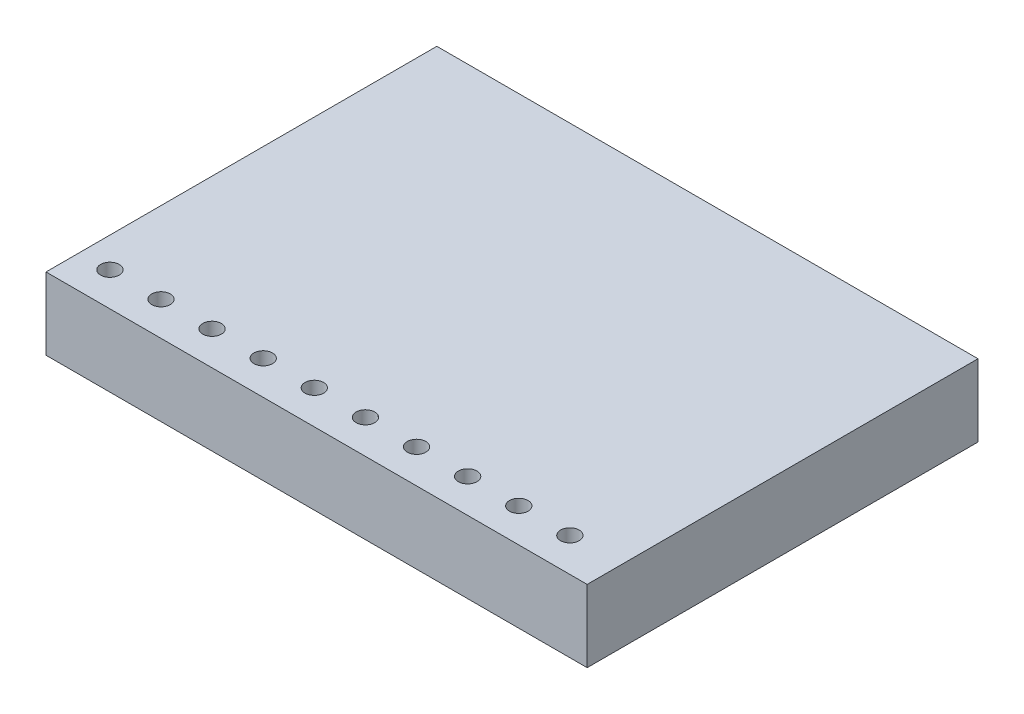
ISO-10303-21;
HEADER;
FILE_DESCRIPTION(('STEP AP214'),'2;1');
FILE_NAME('part.step','',(''),(''),'','','');
FILE_SCHEMA(('AUTOMOTIVE_DESIGN { 1 0 10303 214 1 1 1 1 }'));
ENDSEC;
DATA;
#1=APPLICATION_CONTEXT('core data for automotive mechanical design processes');
#2=APPLICATION_PROTOCOL_DEFINITION('international standard','automotive_design',2000,#1);
#3=PRODUCT_CONTEXT('',#1,'mechanical');
#4=PRODUCT('Part','Part','',(#3));
#5=PRODUCT_RELATED_PRODUCT_CATEGORY('part','',(#4));
#6=PRODUCT_DEFINITION_FORMATION('','',#4);
#7=PRODUCT_DEFINITION_CONTEXT('part definition',#1,'design');
#8=PRODUCT_DEFINITION('design','',#6,#7);
#9=PRODUCT_DEFINITION_SHAPE('','',#8);
#10=(LENGTH_UNIT() NAMED_UNIT(*) SI_UNIT(.MILLI.,.METRE.));
#11=(NAMED_UNIT(*) PLANE_ANGLE_UNIT() SI_UNIT($,.RADIAN.));
#12=(NAMED_UNIT(*) SI_UNIT($,.STERADIAN.) SOLID_ANGLE_UNIT());
#13=UNCERTAINTY_MEASURE_WITH_UNIT(LENGTH_MEASURE(1.E-05),#10,'distance_accuracy_value','');
#14=(GEOMETRIC_REPRESENTATION_CONTEXT(3) GLOBAL_UNCERTAINTY_ASSIGNED_CONTEXT((#13)) GLOBAL_UNIT_ASSIGNED_CONTEXT((#10,
#11,#12)) REPRESENTATION_CONTEXT('',''));
#15=CARTESIAN_POINT('',(0.,0.,0.));
#16=DIRECTION('',(0.,0.,1.));
#17=DIRECTION('',(1.,0.,0.));
#18=AXIS2_PLACEMENT_3D('',#15,#16,#17);
#19=CARTESIAN_POINT('',(-45.,12.,-32.5));
#20=DIRECTION('',(1.,0.,0.));
#21=DIRECTION('',(0.,0.,-1.));
#22=AXIS2_PLACEMENT_3D('',#19,#20,#21);
#23=PLANE('',#22);
#24=DIRECTION('',(0.,0.,1.));
#25=VECTOR('',#24,1.);
#26=CARTESIAN_POINT('',(-45.,0.,-32.5));
#27=LINE('',#26,#25);
#28=CARTESIAN_POINT('',(-45.,0.,-32.5));
#29=VERTEX_POINT('',#28);
#30=CARTESIAN_POINT('',(-45.,0.,32.5));
#31=VERTEX_POINT('',#30);
#32=EDGE_CURVE('E79',#29,#31,#27,.T.);
#33=ORIENTED_EDGE('',*,*,#32,.T.);
#34=DIRECTION('',(0.,-1.,0.));
#35=VECTOR('',#34,1.);
#36=CARTESIAN_POINT('',(-45.,12.,32.5));
#37=LINE('',#36,#35);
#38=CARTESIAN_POINT('',(-45.,12.,32.5));
#39=VERTEX_POINT('',#38);
#40=EDGE_CURVE('E86',#39,#31,#37,.T.);
#41=ORIENTED_EDGE('',*,*,#40,.F.);
#42=DIRECTION('',(0.,0.,1.));
#43=VECTOR('',#42,1.);
#44=CARTESIAN_POINT('',(-45.,12.,-32.5));
#45=LINE('',#44,#43);
#46=CARTESIAN_POINT('',(-45.,12.,-32.5));
#47=VERTEX_POINT('',#46);
#48=EDGE_CURVE('E106',#47,#39,#45,.T.);
#49=ORIENTED_EDGE('',*,*,#48,.F.);
#50=DIRECTION('',(0.,-1.,0.));
#51=VECTOR('',#50,1.);
#52=CARTESIAN_POINT('',(-45.,12.,-32.5));
#53=LINE('',#52,#51);
#54=EDGE_CURVE('E95',#47,#29,#53,.T.);
#55=ORIENTED_EDGE('',*,*,#54,.T.);
#56=EDGE_LOOP('',(#33,#41,#49,#55));
#57=FACE_BOUND('',#56,.T.);
#58=ADVANCED_FACE('F32',(#57),#23,.F.);
#59=CARTESIAN_POINT('',(-45.,12.,32.5));
#60=DIRECTION('',(0.,0.,-1.));
#61=DIRECTION('',(-1.,0.,0.));
#62=AXIS2_PLACEMENT_3D('',#59,#60,#61);
#63=PLANE('',#62);
#64=DIRECTION('',(1.,0.,0.));
#65=VECTOR('',#64,1.);
#66=CARTESIAN_POINT('',(-45.,0.,32.5));
#67=LINE('',#66,#65);
#68=CARTESIAN_POINT('',(45.,0.,32.5));
#69=VERTEX_POINT('',#68);
#70=EDGE_CURVE('E73',#31,#69,#67,.T.);
#71=ORIENTED_EDGE('',*,*,#70,.T.);
#72=DIRECTION('',(0.,-1.,0.));
#73=VECTOR('',#72,1.);
#74=CARTESIAN_POINT('',(45.,12.,32.5));
#75=LINE('',#74,#73);
#76=CARTESIAN_POINT('',(45.,12.,32.5));
#77=VERTEX_POINT('',#76);
#78=EDGE_CURVE('E92',#77,#69,#75,.T.);
#79=ORIENTED_EDGE('',*,*,#78,.F.);
#80=DIRECTION('',(1.,0.,0.));
#81=VECTOR('',#80,1.);
#82=CARTESIAN_POINT('',(-45.,12.,32.5));
#83=LINE('',#82,#81);
#84=EDGE_CURVE('E88',#39,#77,#83,.T.);
#85=ORIENTED_EDGE('',*,*,#84,.F.);
#86=ORIENTED_EDGE('',*,*,#40,.T.);
#87=EDGE_LOOP('',(#71,#79,#85,#86));
#88=FACE_BOUND('',#87,.T.);
#89=ADVANCED_FACE('F87',(#88),#63,.F.);
#90=CARTESIAN_POINT('',(45.,12.,-32.5));
#91=DIRECTION('',(-1.,0.,0.));
#92=DIRECTION('',(0.,0.,1.));
#93=AXIS2_PLACEMENT_3D('',#90,#91,#92);
#94=PLANE('',#93);
#95=DIRECTION('',(0.,0.,-1.));
#96=VECTOR('',#95,1.);
#97=CARTESIAN_POINT('',(45.,0.,-32.5));
#98=LINE('',#97,#96);
#99=CARTESIAN_POINT('',(45.,0.,-32.5));
#100=VERTEX_POINT('',#99);
#101=EDGE_CURVE('E80',#69,#100,#98,.T.);
#102=ORIENTED_EDGE('',*,*,#101,.T.);
#103=DIRECTION('',(0.,-1.,0.));
#104=VECTOR('',#103,1.);
#105=CARTESIAN_POINT('',(45.,12.,-32.5));
#106=LINE('',#105,#104);
#107=CARTESIAN_POINT('',(45.,12.,-32.5));
#108=VERTEX_POINT('',#107);
#109=EDGE_CURVE('E112',#108,#100,#106,.T.);
#110=ORIENTED_EDGE('',*,*,#109,.F.);
#111=DIRECTION('',(0.,0.,-1.));
#112=VECTOR('',#111,1.);
#113=CARTESIAN_POINT('',(45.,12.,-32.5));
#114=LINE('',#113,#112);
#115=EDGE_CURVE('E52',#77,#108,#114,.T.);
#116=ORIENTED_EDGE('',*,*,#115,.F.);
#117=ORIENTED_EDGE('',*,*,#78,.T.);
#118=EDGE_LOOP('',(#102,#110,#116,#117));
#119=FACE_BOUND('',#118,.T.);
#120=ADVANCED_FACE('F177',(#119),#94,.F.);
#121=CARTESIAN_POINT('',(-45.,12.,-32.5));
#122=DIRECTION('',(0.,0.,1.));
#123=DIRECTION('',(1.,0.,0.));
#124=AXIS2_PLACEMENT_3D('',#121,#122,#123);
#125=PLANE('',#124);
#126=DIRECTION('',(-1.,0.,0.));
#127=VECTOR('',#126,1.);
#128=CARTESIAN_POINT('',(-45.,0.,-32.5));
#129=LINE('',#128,#127);
#130=EDGE_CURVE('E104',#100,#29,#129,.T.);
#131=ORIENTED_EDGE('',*,*,#130,.T.);
#132=ORIENTED_EDGE('',*,*,#54,.F.);
#133=DIRECTION('',(-1.,0.,0.));
#134=VECTOR('',#133,1.);
#135=CARTESIAN_POINT('',(-45.,12.,-32.5));
#136=LINE('',#135,#134);
#137=EDGE_CURVE('E47',#108,#47,#136,.T.);
#138=ORIENTED_EDGE('',*,*,#137,.F.);
#139=ORIENTED_EDGE('',*,*,#109,.T.);
#140=EDGE_LOOP('',(#131,#132,#138,#139));
#141=FACE_BOUND('',#140,.T.);
#142=ADVANCED_FACE('F167',(#141),#125,.F.);
#143=CARTESIAN_POINT('',(-45.,12.,32.5));
#144=DIRECTION('',(0.,1.,0.));
#145=DIRECTION('',(0.,0.,1.));
#146=AXIS2_PLACEMENT_3D('',#143,#144,#145);
#147=PLANE('',#146);
#148=CARTESIAN_POINT('',(-31.5,12.,26.8753831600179));
#149=DIRECTION('',(0.,1.,0.));
#150=DIRECTION('',(0.,0.,1.));
#151=AXIS2_PLACEMENT_3D('',#148,#149,#150);
#152=CIRCLE('',#151,1.54680916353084);
#153=CARTESIAN_POINT('',(-31.5,12.,28.4221923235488));
#154=VERTEX_POINT('',#153);
#155=EDGE_CURVE('E343',#154,#154,#152,.T.);
#156=ORIENTED_EDGE('',*,*,#155,.F.);
#157=EDGE_LOOP('',(#156));
#158=FACE_BOUND('',#157,.T.);
#159=CARTESIAN_POINT('',(-40.,12.,26.8753831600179));
#160=DIRECTION('',(0.,1.,0.));
#161=DIRECTION('',(0.,0.,1.));
#162=AXIS2_PLACEMENT_3D('',#159,#160,#161);
#163=CIRCLE('',#162,1.54680916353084);
#164=CARTESIAN_POINT('',(-40.,12.,28.4221923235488));
#165=VERTEX_POINT('',#164);
#166=EDGE_CURVE('E99',#165,#165,#163,.T.);
#167=ORIENTED_EDGE('',*,*,#166,.F.);
#168=EDGE_LOOP('',(#167));
#169=FACE_BOUND('',#168,.T.);
#170=ORIENTED_EDGE('',*,*,#48,.T.);
#171=ORIENTED_EDGE('',*,*,#84,.T.);
#172=ORIENTED_EDGE('',*,*,#115,.T.);
#173=ORIENTED_EDGE('',*,*,#137,.T.);
#174=EDGE_LOOP('',(#170,#171,#172,#173));
#175=FACE_BOUND('',#174,.T.);
#176=CARTESIAN_POINT('',(-23.,12.,26.8753831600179));
#177=DIRECTION('',(0.,1.,0.));
#178=DIRECTION('',(0.,0.,1.));
#179=AXIS2_PLACEMENT_3D('',#176,#177,#178);
#180=CIRCLE('',#179,1.54680916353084);
#181=CARTESIAN_POINT('',(-23.,12.,28.4221923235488));
#182=VERTEX_POINT('',#181);
#183=EDGE_CURVE('E118',#182,#182,#180,.T.);
#184=ORIENTED_EDGE('',*,*,#183,.F.);
#185=EDGE_LOOP('',(#184));
#186=FACE_BOUND('',#185,.T.);
#187=CARTESIAN_POINT('',(-14.5,12.,26.8753831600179));
#188=DIRECTION('',(0.,1.,0.));
#189=DIRECTION('',(0.,0.,1.));
#190=AXIS2_PLACEMENT_3D('',#187,#188,#189);
#191=CIRCLE('',#190,1.54680916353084);
#192=CARTESIAN_POINT('',(-14.5,12.,28.4221923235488));
#193=VERTEX_POINT('',#192);
#194=EDGE_CURVE('E124',#193,#193,#191,.T.);
#195=ORIENTED_EDGE('',*,*,#194,.F.);
#196=EDGE_LOOP('',(#195));
#197=FACE_BOUND('',#196,.T.);
#198=CARTESIAN_POINT('',(-5.99999999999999,12.,26.8753831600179));
#199=DIRECTION('',(0.,1.,0.));
#200=DIRECTION('',(0.,0.,1.));
#201=AXIS2_PLACEMENT_3D('',#198,#199,#200);
#202=CIRCLE('',#201,1.54680916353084);
#203=CARTESIAN_POINT('',(-5.99999999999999,12.,28.4221923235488));
#204=VERTEX_POINT('',#203);
#205=EDGE_CURVE('E130',#204,#204,#202,.T.);
#206=ORIENTED_EDGE('',*,*,#205,.F.);
#207=EDGE_LOOP('',(#206));
#208=FACE_BOUND('',#207,.T.);
#209=CARTESIAN_POINT('',(2.50000000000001,12.,26.8753831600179));
#210=DIRECTION('',(0.,1.,0.));
#211=DIRECTION('',(0.,0.,1.));
#212=AXIS2_PLACEMENT_3D('',#209,#210,#211);
#213=CIRCLE('',#212,1.54680916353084);
#214=CARTESIAN_POINT('',(2.50000000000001,12.,28.4221923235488));
#215=VERTEX_POINT('',#214);
#216=EDGE_CURVE('E136',#215,#215,#213,.T.);
#217=ORIENTED_EDGE('',*,*,#216,.F.);
#218=EDGE_LOOP('',(#217));
#219=FACE_BOUND('',#218,.T.);
#220=CARTESIAN_POINT('',(11.,12.,26.8753831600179));
#221=DIRECTION('',(0.,1.,0.));
#222=DIRECTION('',(0.,0.,1.));
#223=AXIS2_PLACEMENT_3D('',#220,#221,#222);
#224=CIRCLE('',#223,1.54680916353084);
#225=CARTESIAN_POINT('',(11.,12.,28.4221923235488));
#226=VERTEX_POINT('',#225);
#227=EDGE_CURVE('E142',#226,#226,#224,.T.);
#228=ORIENTED_EDGE('',*,*,#227,.F.);
#229=EDGE_LOOP('',(#228));
#230=FACE_BOUND('',#229,.T.);
#231=CARTESIAN_POINT('',(19.5,12.,26.8753831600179));
#232=DIRECTION('',(0.,1.,0.));
#233=DIRECTION('',(0.,0.,1.));
#234=AXIS2_PLACEMENT_3D('',#231,#232,#233);
#235=CIRCLE('',#234,1.54680916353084);
#236=CARTESIAN_POINT('',(19.5,12.,28.4221923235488));
#237=VERTEX_POINT('',#236);
#238=EDGE_CURVE('E148',#237,#237,#235,.T.);
#239=ORIENTED_EDGE('',*,*,#238,.F.);
#240=EDGE_LOOP('',(#239));
#241=FACE_BOUND('',#240,.T.);
#242=CARTESIAN_POINT('',(28.,12.,26.8753831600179));
#243=DIRECTION('',(0.,1.,0.));
#244=DIRECTION('',(0.,0.,1.));
#245=AXIS2_PLACEMENT_3D('',#242,#243,#244);
#246=CIRCLE('',#245,1.54680916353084);
#247=CARTESIAN_POINT('',(28.,12.,28.4221923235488));
#248=VERTEX_POINT('',#247);
#249=EDGE_CURVE('E154',#248,#248,#246,.T.);
#250=ORIENTED_EDGE('',*,*,#249,.F.);
#251=EDGE_LOOP('',(#250));
#252=FACE_BOUND('',#251,.T.);
#253=CARTESIAN_POINT('',(36.5,12.,26.8753831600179));
#254=DIRECTION('',(0.,1.,0.));
#255=DIRECTION('',(0.,0.,1.));
#256=AXIS2_PLACEMENT_3D('',#253,#254,#255);
#257=CIRCLE('',#256,1.54680916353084);
#258=CARTESIAN_POINT('',(36.5,12.,28.4221923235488));
#259=VERTEX_POINT('',#258);
#260=EDGE_CURVE('E11',#259,#259,#257,.T.);
#261=ORIENTED_EDGE('',*,*,#260,.F.);
#262=EDGE_LOOP('',(#261));
#263=FACE_BOUND('',#262,.T.);
#264=ADVANCED_FACE('F165',(#158,#169,#175,#186,#197,#208,#219,#230,#241,#252,#263),#147,.T.);
#265=CARTESIAN_POINT('',(-45.,0.,32.5));
#266=DIRECTION('',(0.,1.,0.));
#267=DIRECTION('',(0.,0.,1.));
#268=AXIS2_PLACEMENT_3D('',#265,#266,#267);
#269=PLANE('',#268);
#270=CARTESIAN_POINT('',(-31.5,0.,26.8753831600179));
#271=DIRECTION('',(0.,1.,0.));
#272=DIRECTION('',(0.,0.,1.));
#273=AXIS2_PLACEMENT_3D('',#270,#271,#272);
#274=CIRCLE('',#273,1.54680916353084);
#275=CARTESIAN_POINT('',(-31.5,0.,28.4221923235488));
#276=VERTEX_POINT('',#275);
#277=EDGE_CURVE('E345',#276,#276,#274,.T.);
#278=ORIENTED_EDGE('',*,*,#277,.T.);
#279=EDGE_LOOP('',(#278));
#280=FACE_BOUND('',#279,.T.);
#281=CARTESIAN_POINT('',(-40.,0.,26.8753831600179));
#282=DIRECTION('',(0.,1.,0.));
#283=DIRECTION('',(0.,0.,1.));
#284=AXIS2_PLACEMENT_3D('',#281,#282,#283);
#285=CIRCLE('',#284,1.54680916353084);
#286=CARTESIAN_POINT('',(-40.,0.,28.4221923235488));
#287=VERTEX_POINT('',#286);
#288=EDGE_CURVE('E96',#287,#287,#285,.T.);
#289=ORIENTED_EDGE('',*,*,#288,.T.);
#290=EDGE_LOOP('',(#289));
#291=FACE_BOUND('',#290,.T.);
#292=ORIENTED_EDGE('',*,*,#32,.F.);
#293=ORIENTED_EDGE('',*,*,#130,.F.);
#294=ORIENTED_EDGE('',*,*,#101,.F.);
#295=ORIENTED_EDGE('',*,*,#70,.F.);
#296=EDGE_LOOP('',(#292,#293,#294,#295));
#297=FACE_BOUND('',#296,.T.);
#298=CARTESIAN_POINT('',(-23.,0.,26.8753831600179));
#299=DIRECTION('',(0.,1.,0.));
#300=DIRECTION('',(0.,0.,1.));
#301=AXIS2_PLACEMENT_3D('',#298,#299,#300);
#302=CIRCLE('',#301,1.54680916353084);
#303=CARTESIAN_POINT('',(-23.,0.,28.4221923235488));
#304=VERTEX_POINT('',#303);
#305=EDGE_CURVE('E91',#304,#304,#302,.T.);
#306=ORIENTED_EDGE('',*,*,#305,.T.);
#307=EDGE_LOOP('',(#306));
#308=FACE_BOUND('',#307,.T.);
#309=CARTESIAN_POINT('',(-14.5,0.,26.8753831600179));
#310=DIRECTION('',(0.,1.,0.));
#311=DIRECTION('',(0.,0.,1.));
#312=AXIS2_PLACEMENT_3D('',#309,#310,#311);
#313=CIRCLE('',#312,1.54680916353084);
#314=CARTESIAN_POINT('',(-14.5,0.,28.4221923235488));
#315=VERTEX_POINT('',#314);
#316=EDGE_CURVE('E121',#315,#315,#313,.T.);
#317=ORIENTED_EDGE('',*,*,#316,.T.);
#318=EDGE_LOOP('',(#317));
#319=FACE_BOUND('',#318,.T.);
#320=CARTESIAN_POINT('',(-5.99999999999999,0.,26.8753831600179));
#321=DIRECTION('',(0.,1.,0.));
#322=DIRECTION('',(0.,0.,1.));
#323=AXIS2_PLACEMENT_3D('',#320,#321,#322);
#324=CIRCLE('',#323,1.54680916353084);
#325=CARTESIAN_POINT('',(-5.99999999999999,0.,28.4221923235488));
#326=VERTEX_POINT('',#325);
#327=EDGE_CURVE('E127',#326,#326,#324,.T.);
#328=ORIENTED_EDGE('',*,*,#327,.T.);
#329=EDGE_LOOP('',(#328));
#330=FACE_BOUND('',#329,.T.);
#331=CARTESIAN_POINT('',(2.50000000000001,0.,26.8753831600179));
#332=DIRECTION('',(0.,1.,0.));
#333=DIRECTION('',(0.,0.,1.));
#334=AXIS2_PLACEMENT_3D('',#331,#332,#333);
#335=CIRCLE('',#334,1.54680916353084);
#336=CARTESIAN_POINT('',(2.50000000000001,0.,28.4221923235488));
#337=VERTEX_POINT('',#336);
#338=EDGE_CURVE('E133',#337,#337,#335,.T.);
#339=ORIENTED_EDGE('',*,*,#338,.T.);
#340=EDGE_LOOP('',(#339));
#341=FACE_BOUND('',#340,.T.);
#342=CARTESIAN_POINT('',(11.,0.,26.8753831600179));
#343=DIRECTION('',(0.,1.,0.));
#344=DIRECTION('',(0.,0.,1.));
#345=AXIS2_PLACEMENT_3D('',#342,#343,#344);
#346=CIRCLE('',#345,1.54680916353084);
#347=CARTESIAN_POINT('',(11.,0.,28.4221923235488));
#348=VERTEX_POINT('',#347);
#349=EDGE_CURVE('E139',#348,#348,#346,.T.);
#350=ORIENTED_EDGE('',*,*,#349,.T.);
#351=EDGE_LOOP('',(#350));
#352=FACE_BOUND('',#351,.T.);
#353=CARTESIAN_POINT('',(19.5,0.,26.8753831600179));
#354=DIRECTION('',(0.,1.,0.));
#355=DIRECTION('',(0.,0.,1.));
#356=AXIS2_PLACEMENT_3D('',#353,#354,#355);
#357=CIRCLE('',#356,1.54680916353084);
#358=CARTESIAN_POINT('',(19.5,0.,28.4221923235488));
#359=VERTEX_POINT('',#358);
#360=EDGE_CURVE('E145',#359,#359,#357,.T.);
#361=ORIENTED_EDGE('',*,*,#360,.T.);
#362=EDGE_LOOP('',(#361));
#363=FACE_BOUND('',#362,.T.);
#364=CARTESIAN_POINT('',(28.,0.,26.8753831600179));
#365=DIRECTION('',(0.,1.,0.));
#366=DIRECTION('',(0.,0.,1.));
#367=AXIS2_PLACEMENT_3D('',#364,#365,#366);
#368=CIRCLE('',#367,1.54680916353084);
#369=CARTESIAN_POINT('',(28.,0.,28.4221923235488));
#370=VERTEX_POINT('',#369);
#371=EDGE_CURVE('E151',#370,#370,#368,.T.);
#372=ORIENTED_EDGE('',*,*,#371,.T.);
#373=EDGE_LOOP('',(#372));
#374=FACE_BOUND('',#373,.T.);
#375=CARTESIAN_POINT('',(36.5,0.,26.8753831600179));
#376=DIRECTION('',(0.,1.,0.));
#377=DIRECTION('',(0.,0.,1.));
#378=AXIS2_PLACEMENT_3D('',#375,#376,#377);
#379=CIRCLE('',#378,1.54680916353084);
#380=CARTESIAN_POINT('',(36.5,0.,28.4221923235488));
#381=VERTEX_POINT('',#380);
#382=EDGE_CURVE('E40',#381,#381,#379,.T.);
#383=ORIENTED_EDGE('',*,*,#382,.T.);
#384=EDGE_LOOP('',(#383));
#385=FACE_BOUND('',#384,.T.);
#386=ADVANCED_FACE('F75',(#280,#291,#297,#308,#319,#330,#341,#352,#363,#374,#385),#269,.F.);
#387=CARTESIAN_POINT('',(-40.,0.,26.8753831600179));
#388=DIRECTION('',(0.,1.,0.));
#389=DIRECTION('',(0.,0.,1.));
#390=AXIS2_PLACEMENT_3D('',#387,#388,#389);
#391=CYLINDRICAL_SURFACE('',#390,1.54680916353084);
#392=ORIENTED_EDGE('',*,*,#288,.F.);
#393=EDGE_LOOP('',(#392));
#394=FACE_BOUND('',#393,.T.);
#395=ORIENTED_EDGE('',*,*,#166,.T.);
#396=EDGE_LOOP('',(#395));
#397=FACE_BOUND('',#396,.T.);
#398=ADVANCED_FACE('F174',(#394,#397),#391,.F.);
#399=CARTESIAN_POINT('',(-31.5,0.,26.8753831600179));
#400=DIRECTION('',(0.,1.,0.));
#401=DIRECTION('',(0.,0.,1.));
#402=AXIS2_PLACEMENT_3D('',#399,#400,#401);
#403=CYLINDRICAL_SURFACE('',#402,1.54680916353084);
#404=ORIENTED_EDGE('',*,*,#277,.F.);
#405=EDGE_LOOP('',(#404));
#406=FACE_BOUND('',#405,.T.);
#407=ORIENTED_EDGE('',*,*,#155,.T.);
#408=EDGE_LOOP('',(#407));
#409=FACE_BOUND('',#408,.T.);
#410=ADVANCED_FACE('F194',(#406,#409),#403,.F.);
#411=CARTESIAN_POINT('',(-23.,0.,26.8753831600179));
#412=DIRECTION('',(0.,1.,0.));
#413=DIRECTION('',(0.,0.,1.));
#414=AXIS2_PLACEMENT_3D('',#411,#412,#413);
#415=CYLINDRICAL_SURFACE('',#414,1.54680916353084);
#416=ORIENTED_EDGE('',*,*,#305,.F.);
#417=EDGE_LOOP('',(#416));
#418=FACE_BOUND('',#417,.T.);
#419=ORIENTED_EDGE('',*,*,#183,.T.);
#420=EDGE_LOOP('',(#419));
#421=FACE_BOUND('',#420,.T.);
#422=ADVANCED_FACE('F190',(#418,#421),#415,.F.);
#423=CARTESIAN_POINT('',(-14.5,0.,26.8753831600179));
#424=DIRECTION('',(0.,1.,0.));
#425=DIRECTION('',(0.,0.,1.));
#426=AXIS2_PLACEMENT_3D('',#423,#424,#425);
#427=CYLINDRICAL_SURFACE('',#426,1.54680916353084);
#428=ORIENTED_EDGE('',*,*,#316,.F.);
#429=EDGE_LOOP('',(#428));
#430=FACE_BOUND('',#429,.T.);
#431=ORIENTED_EDGE('',*,*,#194,.T.);
#432=EDGE_LOOP('',(#431));
#433=FACE_BOUND('',#432,.T.);
#434=ADVANCED_FACE('F193',(#430,#433),#427,.F.);
#435=CARTESIAN_POINT('',(-5.99999999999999,0.,26.8753831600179));
#436=DIRECTION('',(0.,1.,0.));
#437=DIRECTION('',(0.,0.,1.));
#438=AXIS2_PLACEMENT_3D('',#435,#436,#437);
#439=CYLINDRICAL_SURFACE('',#438,1.54680916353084);
#440=ORIENTED_EDGE('',*,*,#327,.F.);
#441=EDGE_LOOP('',(#440));
#442=FACE_BOUND('',#441,.T.);
#443=ORIENTED_EDGE('',*,*,#205,.T.);
#444=EDGE_LOOP('',(#443));
#445=FACE_BOUND('',#444,.T.);
#446=ADVANCED_FACE('F198',(#442,#445),#439,.F.);
#447=CARTESIAN_POINT('',(2.50000000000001,0.,26.8753831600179));
#448=DIRECTION('',(0.,1.,0.));
#449=DIRECTION('',(0.,0.,1.));
#450=AXIS2_PLACEMENT_3D('',#447,#448,#449);
#451=CYLINDRICAL_SURFACE('',#450,1.54680916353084);
#452=ORIENTED_EDGE('',*,*,#338,.F.);
#453=EDGE_LOOP('',(#452));
#454=FACE_BOUND('',#453,.T.);
#455=ORIENTED_EDGE('',*,*,#216,.T.);
#456=EDGE_LOOP('',(#455));
#457=FACE_BOUND('',#456,.T.);
#458=ADVANCED_FACE('F202',(#454,#457),#451,.F.);
#459=CARTESIAN_POINT('',(11.,0.,26.8753831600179));
#460=DIRECTION('',(0.,1.,0.));
#461=DIRECTION('',(0.,0.,1.));
#462=AXIS2_PLACEMENT_3D('',#459,#460,#461);
#463=CYLINDRICAL_SURFACE('',#462,1.54680916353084);
#464=ORIENTED_EDGE('',*,*,#349,.F.);
#465=EDGE_LOOP('',(#464));
#466=FACE_BOUND('',#465,.T.);
#467=ORIENTED_EDGE('',*,*,#227,.T.);
#468=EDGE_LOOP('',(#467));
#469=FACE_BOUND('',#468,.T.);
#470=ADVANCED_FACE('F206',(#466,#469),#463,.F.);
#471=CARTESIAN_POINT('',(19.5,0.,26.8753831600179));
#472=DIRECTION('',(0.,1.,0.));
#473=DIRECTION('',(0.,0.,1.));
#474=AXIS2_PLACEMENT_3D('',#471,#472,#473);
#475=CYLINDRICAL_SURFACE('',#474,1.54680916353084);
#476=ORIENTED_EDGE('',*,*,#360,.F.);
#477=EDGE_LOOP('',(#476));
#478=FACE_BOUND('',#477,.T.);
#479=ORIENTED_EDGE('',*,*,#238,.T.);
#480=EDGE_LOOP('',(#479));
#481=FACE_BOUND('',#480,.T.);
#482=ADVANCED_FACE('F210',(#478,#481),#475,.F.);
#483=CARTESIAN_POINT('',(28.,0.,26.8753831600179));
#484=DIRECTION('',(0.,1.,0.));
#485=DIRECTION('',(0.,0.,1.));
#486=AXIS2_PLACEMENT_3D('',#483,#484,#485);
#487=CYLINDRICAL_SURFACE('',#486,1.54680916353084);
#488=ORIENTED_EDGE('',*,*,#371,.F.);
#489=EDGE_LOOP('',(#488));
#490=FACE_BOUND('',#489,.T.);
#491=ORIENTED_EDGE('',*,*,#249,.T.);
#492=EDGE_LOOP('',(#491));
#493=FACE_BOUND('',#492,.T.);
#494=ADVANCED_FACE('F162',(#490,#493),#487,.F.);
#495=CARTESIAN_POINT('',(36.5,0.,26.8753831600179));
#496=DIRECTION('',(0.,1.,0.));
#497=DIRECTION('',(0.,0.,1.));
#498=AXIS2_PLACEMENT_3D('',#495,#496,#497);
#499=CYLINDRICAL_SURFACE('',#498,1.54680916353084);
#500=ORIENTED_EDGE('',*,*,#382,.F.);
#501=EDGE_LOOP('',(#500));
#502=FACE_BOUND('',#501,.T.);
#503=ORIENTED_EDGE('',*,*,#260,.T.);
#504=EDGE_LOOP('',(#503));
#505=FACE_BOUND('',#504,.T.);
#506=ADVANCED_FACE('F34',(#502,#505),#499,.F.);
#507=CLOSED_SHELL('',(#58,#89,#120,#142,#264,#386,#398,#410,#422,#434,#446,#458,#470,#482,#494,#506));
#508=MANIFOLD_SOLID_BREP('B2',#507);
#509=ADVANCED_BREP_SHAPE_REPRESENTATION('',(#18,#508),#14);
#510=SHAPE_DEFINITION_REPRESENTATION(#9,#509);
ENDSEC;
END-ISO-10303-21;
